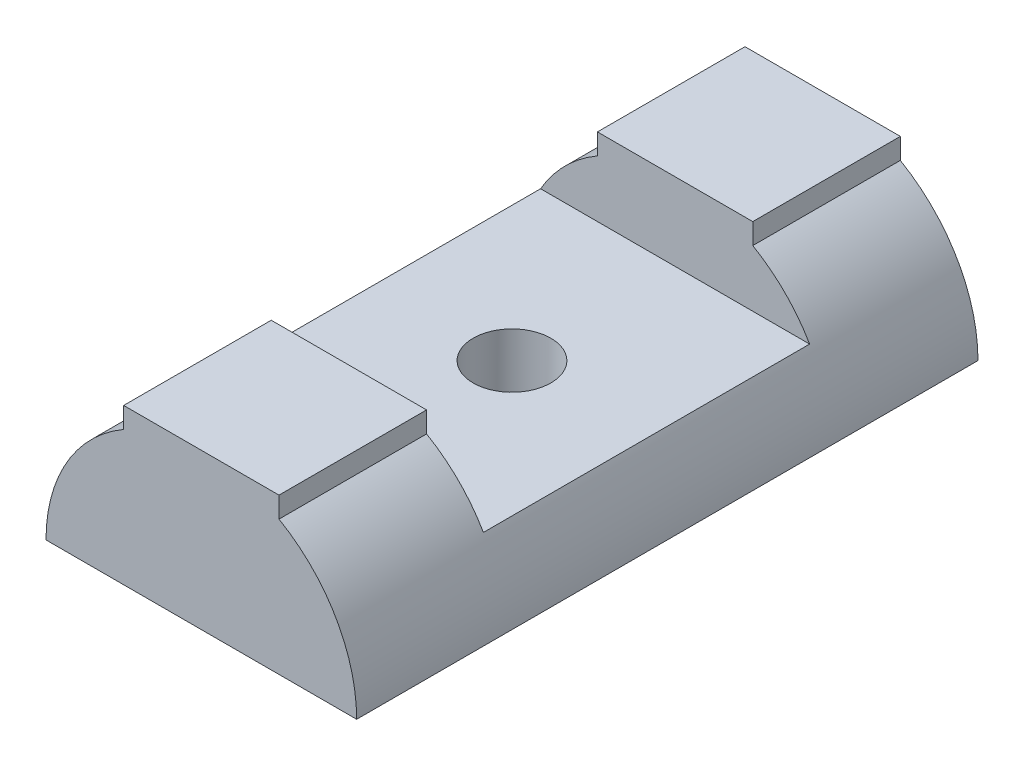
ISO-10303-21;
HEADER;
FILE_DESCRIPTION(('STEP AP214'),'2;1');
FILE_NAME('part.step','',(''),(''),'','','');
FILE_SCHEMA(('AUTOMOTIVE_DESIGN { 1 0 10303 214 1 1 1 1 }'));
ENDSEC;
DATA;
#1=APPLICATION_CONTEXT('core data for automotive mechanical design processes');
#2=APPLICATION_PROTOCOL_DEFINITION('international standard','automotive_design',2000,#1);
#3=PRODUCT_CONTEXT('',#1,'mechanical');
#4=PRODUCT('Part','Part','',(#3));
#5=PRODUCT_RELATED_PRODUCT_CATEGORY('part','',(#4));
#6=PRODUCT_DEFINITION_FORMATION('','',#4);
#7=PRODUCT_DEFINITION_CONTEXT('part definition',#1,'design');
#8=PRODUCT_DEFINITION('design','',#6,#7);
#9=PRODUCT_DEFINITION_SHAPE('','',#8);
#10=(LENGTH_UNIT() NAMED_UNIT(*) SI_UNIT(.MILLI.,.METRE.));
#11=(NAMED_UNIT(*) PLANE_ANGLE_UNIT() SI_UNIT($,.RADIAN.));
#12=(NAMED_UNIT(*) SI_UNIT($,.STERADIAN.) SOLID_ANGLE_UNIT());
#13=UNCERTAINTY_MEASURE_WITH_UNIT(LENGTH_MEASURE(1.E-05),#10,'distance_accuracy_value','');
#14=(GEOMETRIC_REPRESENTATION_CONTEXT(3) GLOBAL_UNCERTAINTY_ASSIGNED_CONTEXT((#13)) GLOBAL_UNIT_ASSIGNED_CONTEXT((#10,
#11,#12)) REPRESENTATION_CONTEXT('',''));
#15=CARTESIAN_POINT('',(0.,0.,0.));
#16=DIRECTION('',(0.,0.,1.));
#17=DIRECTION('',(1.,0.,0.));
#18=AXIS2_PLACEMENT_3D('',#15,#16,#17);
#19=CARTESIAN_POINT('',(0.,0.,20.));
#20=DIRECTION('',(0.,0.,-1.));
#21=DIRECTION('',(-1.,0.,0.));
#22=AXIS2_PLACEMENT_3D('',#19,#20,#21);
#23=CYLINDRICAL_SURFACE('',#22,10.);
#24=CARTESIAN_POINT('',(0.,0.,-20.));
#25=DIRECTION('',(0.,0.,1.));
#26=DIRECTION('',(1.,0.,0.));
#27=AXIS2_PLACEMENT_3D('',#24,#25,#26);
#28=CIRCLE('',#27,10.);
#29=CARTESIAN_POINT('',(-5.,8.66025403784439,-20.));
#30=VERTEX_POINT('',#29);
#31=CARTESIAN_POINT('',(-10.,0.,-20.));
#32=VERTEX_POINT('',#31);
#33=EDGE_CURVE('E144',#30,#32,#28,.T.);
#34=ORIENTED_EDGE('',*,*,#33,.T.);
#35=DIRECTION('',(0.,0.,1.));
#36=VECTOR('',#35,1.);
#37=CARTESIAN_POINT('',(-10.,0.,-20.));
#38=LINE('',#37,#36);
#39=CARTESIAN_POINT('',(-10.,0.,20.));
#40=VERTEX_POINT('',#39);
#41=EDGE_CURVE('E48',#32,#40,#38,.T.);
#42=ORIENTED_EDGE('',*,*,#41,.T.);
#43=CARTESIAN_POINT('',(0.,0.,20.));
#44=DIRECTION('',(0.,0.,1.));
#45=DIRECTION('',(1.,0.,0.));
#46=AXIS2_PLACEMENT_3D('',#43,#44,#45);
#47=CIRCLE('',#46,10.);
#48=CARTESIAN_POINT('',(-5.,8.66025403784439,20.));
#49=VERTEX_POINT('',#48);
#50=EDGE_CURVE('E152',#49,#40,#47,.T.);
#51=ORIENTED_EDGE('',*,*,#50,.F.);
#52=DIRECTION('',(0.,0.,-1.));
#53=VECTOR('',#52,1.);
#54=CARTESIAN_POINT('',(-5.,8.66025403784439,20.));
#55=LINE('',#54,#53);
#56=CARTESIAN_POINT('',(-5.,8.66025403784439,10.5));
#57=VERTEX_POINT('',#56);
#58=EDGE_CURVE('E145',#49,#57,#55,.T.);
#59=ORIENTED_EDGE('',*,*,#58,.T.);
#60=CARTESIAN_POINT('',(0.,0.,10.5));
#61=DIRECTION('',(0.,0.,1.));
#62=DIRECTION('',(1.,0.,0.));
#63=AXIS2_PLACEMENT_3D('',#60,#61,#62);
#64=CIRCLE('',#63,10.);
#65=CARTESIAN_POINT('',(-8.66025403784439,5.,10.5));
#66=VERTEX_POINT('',#65);
#67=EDGE_CURVE('E208',#57,#66,#64,.T.);
#68=ORIENTED_EDGE('',*,*,#67,.T.);
#69=DIRECTION('',(0.,0.,1.));
#70=VECTOR('',#69,1.);
#71=CARTESIAN_POINT('',(-8.66025403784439,5.,-10.5));
#72=LINE('',#71,#70);
#73=CARTESIAN_POINT('',(-8.66025403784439,5.,-10.5));
#74=VERTEX_POINT('',#73);
#75=EDGE_CURVE('E215',#74,#66,#72,.T.);
#76=ORIENTED_EDGE('',*,*,#75,.F.);
#77=CARTESIAN_POINT('',(0.,0.,-10.5));
#78=DIRECTION('',(0.,0.,1.));
#79=DIRECTION('',(1.,0.,0.));
#80=AXIS2_PLACEMENT_3D('',#77,#78,#79);
#81=CIRCLE('',#80,10.);
#82=CARTESIAN_POINT('',(-5.,8.66025403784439,-10.5));
#83=VERTEX_POINT('',#82);
#84=EDGE_CURVE('E178',#83,#74,#81,.T.);
#85=ORIENTED_EDGE('',*,*,#84,.F.);
#86=EDGE_CURVE('E148',#83,#30,#55,.T.);
#87=ORIENTED_EDGE('',*,*,#86,.T.);
#88=EDGE_LOOP('',(#34,#42,#51,#59,#68,#76,#85,#87));
#89=FACE_BOUND('',#88,.T.);
#90=ADVANCED_FACE('F33',(#89),#23,.T.);
#91=CARTESIAN_POINT('',(10.,0.,20.));
#92=VERTEX_POINT('',#91);
#93=CARTESIAN_POINT('',(5.,8.66025403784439,20.));
#94=VERTEX_POINT('',#93);
#95=EDGE_CURVE('E138',#92,#94,#47,.T.);
#96=ORIENTED_EDGE('',*,*,#95,.F.);
#97=DIRECTION('',(0.,0.,1.));
#98=VECTOR('',#97,1.);
#99=CARTESIAN_POINT('',(10.,0.,-20.));
#100=LINE('',#99,#98);
#101=CARTESIAN_POINT('',(10.,0.,-20.));
#102=VERTEX_POINT('',#101);
#103=EDGE_CURVE('E123',#102,#92,#100,.T.);
#104=ORIENTED_EDGE('',*,*,#103,.F.);
#105=CARTESIAN_POINT('',(5.,8.66025403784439,-20.));
#106=VERTEX_POINT('',#105);
#107=EDGE_CURVE('E135',#102,#106,#28,.T.);
#108=ORIENTED_EDGE('',*,*,#107,.T.);
#109=DIRECTION('',(0.,0.,-1.));
#110=VECTOR('',#109,1.);
#111=CARTESIAN_POINT('',(5.,8.66025403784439,20.));
#112=LINE('',#111,#110);
#113=CARTESIAN_POINT('',(5.,8.66025403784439,-10.5));
#114=VERTEX_POINT('',#113);
#115=EDGE_CURVE('E168',#106,#114,#112,.F.);
#116=ORIENTED_EDGE('',*,*,#115,.T.);
#117=CARTESIAN_POINT('',(0.,0.,-10.5));
#118=DIRECTION('',(0.,0.,1.));
#119=DIRECTION('',(1.,0.,0.));
#120=AXIS2_PLACEMENT_3D('',#117,#118,#119);
#121=CIRCLE('',#120,10.);
#122=CARTESIAN_POINT('',(8.66025403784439,5.,-10.5));
#123=VERTEX_POINT('',#122);
#124=EDGE_CURVE('E206',#123,#114,#121,.T.);
#125=ORIENTED_EDGE('',*,*,#124,.F.);
#126=DIRECTION('',(0.,0.,1.));
#127=VECTOR('',#126,1.);
#128=CARTESIAN_POINT('',(8.66025403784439,5.,-10.5));
#129=LINE('',#128,#127);
#130=CARTESIAN_POINT('',(8.66025403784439,5.,10.5));
#131=VERTEX_POINT('',#130);
#132=EDGE_CURVE('E214',#123,#131,#129,.T.);
#133=ORIENTED_EDGE('',*,*,#132,.T.);
#134=CARTESIAN_POINT('',(0.,0.,10.5));
#135=DIRECTION('',(0.,0.,1.));
#136=DIRECTION('',(1.,0.,0.));
#137=AXIS2_PLACEMENT_3D('',#134,#135,#136);
#138=CIRCLE('',#137,10.);
#139=CARTESIAN_POINT('',(5.,8.66025403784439,10.5));
#140=VERTEX_POINT('',#139);
#141=EDGE_CURVE('E166',#131,#140,#138,.T.);
#142=ORIENTED_EDGE('',*,*,#141,.T.);
#143=EDGE_CURVE('E164',#140,#94,#112,.F.);
#144=ORIENTED_EDGE('',*,*,#143,.T.);
#145=EDGE_LOOP('',(#96,#104,#108,#116,#125,#133,#142,#144));
#146=FACE_BOUND('',#145,.T.);
#147=ADVANCED_FACE('F133',(#146),#23,.T.);
#148=CARTESIAN_POINT('',(-5.,-10.,-42.3606797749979));
#149=DIRECTION('',(-1.,0.,0.));
#150=DIRECTION('',(0.,0.,1.));
#151=AXIS2_PLACEMENT_3D('',#148,#149,#150);
#152=PLANE('',#151);
#153=ORIENTED_EDGE('',*,*,#86,.F.);
#154=DIRECTION('',(0.,1.,0.));
#155=VECTOR('',#154,1.);
#156=CARTESIAN_POINT('',(-5.,-10.,-10.5));
#157=LINE('',#156,#155);
#158=CARTESIAN_POINT('',(-5.,10.,-10.5));
#159=VERTEX_POINT('',#158);
#160=EDGE_CURVE('E204',#83,#159,#157,.T.);
#161=ORIENTED_EDGE('',*,*,#160,.T.);
#162=DIRECTION('',(0.,0.,1.));
#163=VECTOR('',#162,1.);
#164=CARTESIAN_POINT('',(-5.,10.,-42.3606797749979));
#165=LINE('',#164,#163);
#166=CARTESIAN_POINT('',(-5.,10.,-20.));
#167=VERTEX_POINT('',#166);
#168=EDGE_CURVE('E182',#167,#159,#165,.T.);
#169=ORIENTED_EDGE('',*,*,#168,.F.);
#170=DIRECTION('',(0.,1.,0.));
#171=VECTOR('',#170,1.);
#172=CARTESIAN_POINT('',(-5.,-10.,-20.));
#173=LINE('',#172,#171);
#174=EDGE_CURVE('E169',#30,#167,#173,.T.);
#175=ORIENTED_EDGE('',*,*,#174,.F.);
#176=EDGE_LOOP('',(#153,#161,#169,#175));
#177=FACE_BOUND('',#176,.T.);
#178=ADVANCED_FACE('F198',(#177),#152,.T.);
#179=CARTESIAN_POINT('',(5.,10.,-42.3606797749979));
#180=DIRECTION('',(0.,1.,0.));
#181=DIRECTION('',(0.,0.,1.));
#182=AXIS2_PLACEMENT_3D('',#179,#180,#181);
#183=PLANE('',#182);
#184=ORIENTED_EDGE('',*,*,#168,.T.);
#185=DIRECTION('',(-1.,0.,0.));
#186=VECTOR('',#185,1.);
#187=CARTESIAN_POINT('',(8.66025403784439,10.,-10.5));
#188=LINE('',#187,#186);
#189=CARTESIAN_POINT('',(5.,10.,-10.5));
#190=VERTEX_POINT('',#189);
#191=EDGE_CURVE('E217',#190,#159,#188,.T.);
#192=ORIENTED_EDGE('',*,*,#191,.F.);
#193=DIRECTION('',(0.,0.,1.));
#194=VECTOR('',#193,1.);
#195=CARTESIAN_POINT('',(5.,10.,-42.3606797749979));
#196=LINE('',#195,#194);
#197=CARTESIAN_POINT('',(5.,10.,-20.));
#198=VERTEX_POINT('',#197);
#199=EDGE_CURVE('E186',#198,#190,#196,.T.);
#200=ORIENTED_EDGE('',*,*,#199,.F.);
#201=DIRECTION('',(1.,0.,0.));
#202=VECTOR('',#201,1.);
#203=CARTESIAN_POINT('',(5.,10.,-20.));
#204=LINE('',#203,#202);
#205=EDGE_CURVE('E199',#167,#198,#204,.T.);
#206=ORIENTED_EDGE('',*,*,#205,.F.);
#207=EDGE_LOOP('',(#184,#192,#200,#206));
#208=FACE_BOUND('',#207,.T.);
#209=ADVANCED_FACE('F241',(#208),#183,.T.);
#210=CARTESIAN_POINT('',(5.,-10.,-42.3606797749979));
#211=DIRECTION('',(1.,0.,0.));
#212=DIRECTION('',(0.,0.,-1.));
#213=AXIS2_PLACEMENT_3D('',#210,#211,#212);
#214=PLANE('',#213);
#215=ORIENTED_EDGE('',*,*,#199,.T.);
#216=DIRECTION('',(0.,-1.,0.));
#217=VECTOR('',#216,1.);
#218=CARTESIAN_POINT('',(5.,-10.,-10.5));
#219=LINE('',#218,#217);
#220=EDGE_CURVE('E12',#190,#114,#219,.T.);
#221=ORIENTED_EDGE('',*,*,#220,.T.);
#222=ORIENTED_EDGE('',*,*,#115,.F.);
#223=DIRECTION('',(0.,-1.,0.));
#224=VECTOR('',#223,1.);
#225=CARTESIAN_POINT('',(5.,-10.,-20.));
#226=LINE('',#225,#224);
#227=EDGE_CURVE('E143',#198,#106,#226,.T.);
#228=ORIENTED_EDGE('',*,*,#227,.F.);
#229=EDGE_LOOP('',(#215,#221,#222,#228));
#230=FACE_BOUND('',#229,.T.);
#231=ADVANCED_FACE('F248',(#230),#214,.T.);
#232=CARTESIAN_POINT('',(0.,0.,20.));
#233=DIRECTION('',(0.,0.,1.));
#234=DIRECTION('',(1.,0.,0.));
#235=AXIS2_PLACEMENT_3D('',#232,#233,#234);
#236=PLANE('',#235);
#237=DIRECTION('',(-1.,0.,0.));
#238=VECTOR('',#237,1.);
#239=CARTESIAN_POINT('',(10.,0.,20.));
#240=LINE('',#239,#238);
#241=EDGE_CURVE('E129',#92,#40,#240,.T.);
#242=ORIENTED_EDGE('',*,*,#241,.F.);
#243=ORIENTED_EDGE('',*,*,#95,.T.);
#244=DIRECTION('',(0.,1.,0.));
#245=VECTOR('',#244,1.);
#246=CARTESIAN_POINT('',(5.,-10.,20.));
#247=LINE('',#246,#245);
#248=CARTESIAN_POINT('',(5.,10.,20.));
#249=VERTEX_POINT('',#248);
#250=EDGE_CURVE('E161',#94,#249,#247,.T.);
#251=ORIENTED_EDGE('',*,*,#250,.T.);
#252=DIRECTION('',(-1.,0.,0.));
#253=VECTOR('',#252,1.);
#254=CARTESIAN_POINT('',(5.,10.,20.));
#255=LINE('',#254,#253);
#256=CARTESIAN_POINT('',(-5.,10.,20.));
#257=VERTEX_POINT('',#256);
#258=EDGE_CURVE('E174',#249,#257,#255,.T.);
#259=ORIENTED_EDGE('',*,*,#258,.T.);
#260=DIRECTION('',(0.,-1.,0.));
#261=VECTOR('',#260,1.);
#262=CARTESIAN_POINT('',(-5.,-10.,20.));
#263=LINE('',#262,#261);
#264=EDGE_CURVE('E175',#257,#49,#263,.T.);
#265=ORIENTED_EDGE('',*,*,#264,.T.);
#266=ORIENTED_EDGE('',*,*,#50,.T.);
#267=EDGE_LOOP('',(#242,#243,#251,#259,#265,#266));
#268=FACE_BOUND('',#267,.T.);
#269=ADVANCED_FACE('F158',(#268),#236,.T.);
#270=CARTESIAN_POINT('',(0.,0.,-20.));
#271=DIRECTION('',(0.,0.,1.));
#272=DIRECTION('',(1.,0.,0.));
#273=AXIS2_PLACEMENT_3D('',#270,#271,#272);
#274=PLANE('',#273);
#275=ORIENTED_EDGE('',*,*,#107,.F.);
#276=DIRECTION('',(-1.,0.,0.));
#277=VECTOR('',#276,1.);
#278=CARTESIAN_POINT('',(10.,0.,-20.));
#279=LINE('',#278,#277);
#280=EDGE_CURVE('E119',#102,#32,#279,.T.);
#281=ORIENTED_EDGE('',*,*,#280,.T.);
#282=ORIENTED_EDGE('',*,*,#33,.F.);
#283=ORIENTED_EDGE('',*,*,#174,.T.);
#284=ORIENTED_EDGE('',*,*,#205,.T.);
#285=ORIENTED_EDGE('',*,*,#227,.T.);
#286=EDGE_LOOP('',(#275,#281,#282,#283,#284,#285));
#287=FACE_BOUND('',#286,.T.);
#288=ADVANCED_FACE('F141',(#287),#274,.F.);
#289=DIRECTION('',(0.,1.,0.));
#290=VECTOR('',#289,1.);
#291=CARTESIAN_POINT('',(-5.,-10.,10.5));
#292=LINE('',#291,#290);
#293=CARTESIAN_POINT('',(-5.,10.,10.5));
#294=VERTEX_POINT('',#293);
#295=EDGE_CURVE('E211',#57,#294,#292,.T.);
#296=ORIENTED_EDGE('',*,*,#295,.F.);
#297=ORIENTED_EDGE('',*,*,#58,.F.);
#298=ORIENTED_EDGE('',*,*,#264,.F.);
#299=EDGE_CURVE('E185',#294,#257,#165,.T.);
#300=ORIENTED_EDGE('',*,*,#299,.F.);
#301=EDGE_LOOP('',(#296,#297,#298,#300));
#302=FACE_BOUND('',#301,.T.);
#303=ADVANCED_FACE('F235',(#302),#152,.T.);
#304=DIRECTION('',(-1.,0.,0.));
#305=VECTOR('',#304,1.);
#306=CARTESIAN_POINT('',(8.66025403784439,10.,10.5));
#307=LINE('',#306,#305);
#308=CARTESIAN_POINT('',(5.,10.,10.5));
#309=VERTEX_POINT('',#308);
#310=EDGE_CURVE('E56',#309,#294,#307,.T.);
#311=ORIENTED_EDGE('',*,*,#310,.T.);
#312=ORIENTED_EDGE('',*,*,#299,.T.);
#313=ORIENTED_EDGE('',*,*,#258,.F.);
#314=EDGE_CURVE('E173',#309,#249,#196,.T.);
#315=ORIENTED_EDGE('',*,*,#314,.F.);
#316=EDGE_LOOP('',(#311,#312,#313,#315));
#317=FACE_BOUND('',#316,.T.);
#318=ADVANCED_FACE('F238',(#317),#183,.T.);
#319=DIRECTION('',(0.,-1.,0.));
#320=VECTOR('',#319,1.);
#321=CARTESIAN_POINT('',(5.,-10.,10.5));
#322=LINE('',#321,#320);
#323=EDGE_CURVE('E41',#309,#140,#322,.T.);
#324=ORIENTED_EDGE('',*,*,#323,.F.);
#325=ORIENTED_EDGE('',*,*,#314,.T.);
#326=ORIENTED_EDGE('',*,*,#250,.F.);
#327=ORIENTED_EDGE('',*,*,#143,.F.);
#328=EDGE_LOOP('',(#324,#325,#326,#327));
#329=FACE_BOUND('',#328,.T.);
#330=ADVANCED_FACE('F171',(#329),#214,.T.);
#331=CARTESIAN_POINT('',(0.,0.,-10.5));
#332=DIRECTION('',(0.,0.,1.));
#333=DIRECTION('',(1.,0.,0.));
#334=AXIS2_PLACEMENT_3D('',#331,#332,#333);
#335=PLANE('',#334);
#336=ORIENTED_EDGE('',*,*,#84,.T.);
#337=DIRECTION('',(1.,0.,0.));
#338=VECTOR('',#337,1.);
#339=CARTESIAN_POINT('',(8.66025403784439,5.,-10.5));
#340=LINE('',#339,#338);
#341=EDGE_CURVE('E220',#74,#123,#340,.T.);
#342=ORIENTED_EDGE('',*,*,#341,.T.);
#343=ORIENTED_EDGE('',*,*,#124,.T.);
#344=ORIENTED_EDGE('',*,*,#220,.F.);
#345=ORIENTED_EDGE('',*,*,#191,.T.);
#346=ORIENTED_EDGE('',*,*,#160,.F.);
#347=EDGE_LOOP('',(#336,#342,#343,#344,#345,#346));
#348=FACE_BOUND('',#347,.T.);
#349=ADVANCED_FACE('F246',(#348),#335,.T.);
#350=CARTESIAN_POINT('',(0.,0.,10.5));
#351=DIRECTION('',(0.,0.,1.));
#352=DIRECTION('',(1.,0.,0.));
#353=AXIS2_PLACEMENT_3D('',#350,#351,#352);
#354=PLANE('',#353);
#355=ORIENTED_EDGE('',*,*,#295,.T.);
#356=ORIENTED_EDGE('',*,*,#310,.F.);
#357=ORIENTED_EDGE('',*,*,#323,.T.);
#358=ORIENTED_EDGE('',*,*,#141,.F.);
#359=DIRECTION('',(1.,0.,0.));
#360=VECTOR('',#359,1.);
#361=CARTESIAN_POINT('',(8.66025403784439,5.,10.5));
#362=LINE('',#361,#360);
#363=EDGE_CURVE('E221',#66,#131,#362,.T.);
#364=ORIENTED_EDGE('',*,*,#363,.F.);
#365=ORIENTED_EDGE('',*,*,#67,.F.);
#366=EDGE_LOOP('',(#355,#356,#357,#358,#364,#365));
#367=FACE_BOUND('',#366,.T.);
#368=ADVANCED_FACE('F298',(#367),#354,.F.);
#369=CARTESIAN_POINT('',(8.66025403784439,5.,-10.5));
#370=DIRECTION('',(0.,-1.,0.));
#371=DIRECTION('',(0.,0.,-1.));
#372=AXIS2_PLACEMENT_3D('',#369,#370,#371);
#373=PLANE('',#372);
#374=CARTESIAN_POINT('',(0.,5.,0.));
#375=DIRECTION('',(0.,1.,0.));
#376=DIRECTION('',(0.,0.,1.));
#377=AXIS2_PLACEMENT_3D('',#374,#375,#376);
#378=CIRCLE('',#377,2.5);
#379=CARTESIAN_POINT('',(0.,5.,2.5));
#380=VERTEX_POINT('',#379);
#381=EDGE_CURVE('E224',#380,#380,#378,.T.);
#382=ORIENTED_EDGE('',*,*,#381,.F.);
#383=EDGE_LOOP('',(#382));
#384=FACE_BOUND('',#383,.T.);
#385=ORIENTED_EDGE('',*,*,#363,.T.);
#386=ORIENTED_EDGE('',*,*,#132,.F.);
#387=ORIENTED_EDGE('',*,*,#341,.F.);
#388=ORIENTED_EDGE('',*,*,#75,.T.);
#389=EDGE_LOOP('',(#385,#386,#387,#388));
#390=FACE_BOUND('',#389,.T.);
#391=ADVANCED_FACE('F309',(#384,#390),#373,.F.);
#392=CARTESIAN_POINT('',(0.,-10.,0.));
#393=DIRECTION('',(0.,1.,0.));
#394=DIRECTION('',(0.,0.,1.));
#395=AXIS2_PLACEMENT_3D('',#392,#393,#394);
#396=CYLINDRICAL_SURFACE('',#395,2.5);
#397=CARTESIAN_POINT('',(0.,0.,0.));
#398=DIRECTION('',(0.,1.,0.));
#399=DIRECTION('',(-1.,0.,0.));
#400=AXIS2_PLACEMENT_3D('',#397,#398,#399);
#401=CIRCLE('',#400,2.5);
#402=CARTESIAN_POINT('',(-2.5,0.,0.));
#403=VERTEX_POINT('',#402);
#404=EDGE_CURVE('E36',#403,#403,#401,.F.);
#405=ORIENTED_EDGE('',*,*,#404,.T.);
#406=EDGE_LOOP('',(#405));
#407=FACE_BOUND('',#406,.T.);
#408=ORIENTED_EDGE('',*,*,#381,.T.);
#409=EDGE_LOOP('',(#408));
#410=FACE_BOUND('',#409,.T.);
#411=ADVANCED_FACE('F317',(#407,#410),#396,.F.);
#412=CARTESIAN_POINT('',(10.,0.,-20.));
#413=DIRECTION('',(0.,1.,0.));
#414=DIRECTION('',(-1.,0.,0.));
#415=AXIS2_PLACEMENT_3D('',#412,#413,#414);
#416=PLANE('',#415);
#417=ORIENTED_EDGE('',*,*,#241,.T.);
#418=ORIENTED_EDGE('',*,*,#41,.F.);
#419=ORIENTED_EDGE('',*,*,#280,.F.);
#420=ORIENTED_EDGE('',*,*,#103,.T.);
#421=EDGE_LOOP('',(#417,#418,#419,#420));
#422=FACE_BOUND('',#421,.T.);
#423=ORIENTED_EDGE('',*,*,#404,.F.);
#424=EDGE_LOOP('',(#423));
#425=FACE_BOUND('',#424,.T.);
#426=ADVANCED_FACE('F121',(#422,#425),#416,.F.);
#427=CLOSED_SHELL('',(#90,#147,#178,#209,#231,#269,#288,#303,#318,#330,#349,#368,#391,#411,#426));
#428=MANIFOLD_SOLID_BREP('B2',#427);
#429=ADVANCED_BREP_SHAPE_REPRESENTATION('',(#18,#428),#14);
#430=SHAPE_DEFINITION_REPRESENTATION(#9,#429);
ENDSEC;
END-ISO-10303-21;
